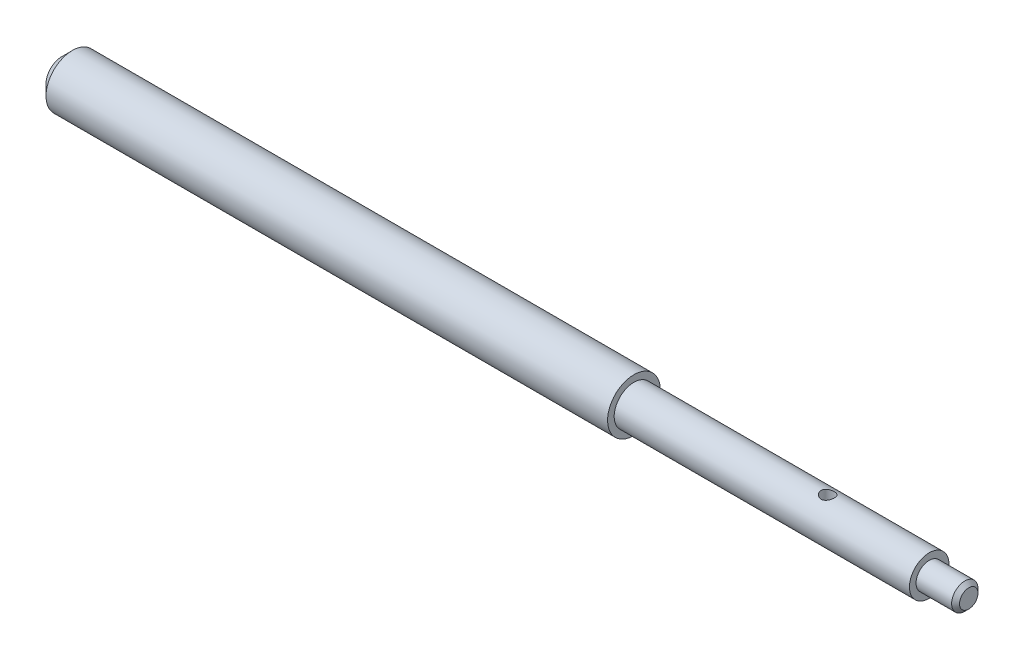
ISO-10303-21;
HEADER;
FILE_DESCRIPTION(('STEP AP214'),'2;1');
FILE_NAME('part.step','',(''),(''),'','','');
FILE_SCHEMA(('AUTOMOTIVE_DESIGN { 1 0 10303 214 1 1 1 1 }'));
ENDSEC;
DATA;
#1=APPLICATION_CONTEXT('core data for automotive mechanical design processes');
#2=APPLICATION_PROTOCOL_DEFINITION('international standard','automotive_design',2000,#1);
#3=PRODUCT_CONTEXT('',#1,'mechanical');
#4=PRODUCT('Part','Part','',(#3));
#5=PRODUCT_RELATED_PRODUCT_CATEGORY('part','',(#4));
#6=PRODUCT_DEFINITION_FORMATION('','',#4);
#7=PRODUCT_DEFINITION_CONTEXT('part definition',#1,'design');
#8=PRODUCT_DEFINITION('design','',#6,#7);
#9=PRODUCT_DEFINITION_SHAPE('','',#8);
#10=(LENGTH_UNIT() NAMED_UNIT(*) SI_UNIT(.MILLI.,.METRE.));
#11=(NAMED_UNIT(*) PLANE_ANGLE_UNIT() SI_UNIT($,.RADIAN.));
#12=(NAMED_UNIT(*) SI_UNIT($,.STERADIAN.) SOLID_ANGLE_UNIT());
#13=UNCERTAINTY_MEASURE_WITH_UNIT(LENGTH_MEASURE(1.E-05),#10,'distance_accuracy_value','');
#14=(GEOMETRIC_REPRESENTATION_CONTEXT(3) GLOBAL_UNCERTAINTY_ASSIGNED_CONTEXT((#13)) GLOBAL_UNIT_ASSIGNED_CONTEXT((#10,
#11,#12)) REPRESENTATION_CONTEXT('',''));
#15=CARTESIAN_POINT('',(0.,0.,0.));
#16=DIRECTION('',(0.,0.,1.));
#17=DIRECTION('',(1.,0.,0.));
#18=AXIS2_PLACEMENT_3D('',#15,#16,#17);
#19=CARTESIAN_POINT('',(303.948321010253,9.92894053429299,0.));
#20=DIRECTION('',(1.,0.,0.));
#21=DIRECTION('',(0.,0.,-1.));
#22=AXIS2_PLACEMENT_3D('',#19,#20,#21);
#23=PLANE('',#22);
#24=CARTESIAN_POINT('',(303.948321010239,7.428940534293,0.));
#25=DIRECTION('',(-1.,0.,0.));
#26=DIRECTION('',(0.,0.,1.));
#27=AXIS2_PLACEMENT_3D('',#24,#25,#26);
#28=CIRCLE('',#27,3.50000000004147);
#29=CARTESIAN_POINT('',(303.948321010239,7.428940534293,3.50000000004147));
#30=VERTEX_POINT('',#29);
#31=EDGE_CURVE('E20',#30,#30,#28,.T.);
#32=ORIENTED_EDGE('',*,*,#31,.F.);
#33=EDGE_LOOP('',(#32));
#34=FACE_BOUND('',#33,.T.);
#35=ADVANCED_FACE('F16',(#34),#23,.T.);
#36=CARTESIAN_POINT('',(302.448321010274,7.428940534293,0.));
#37=DIRECTION('',(-1.,0.,0.));
#38=DIRECTION('',(0.,0.,1.));
#39=AXIS2_PLACEMENT_3D('',#36,#37,#38);
#40=CONICAL_SURFACE('',#39,5.000000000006,0.785398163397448);
#41=CARTESIAN_POINT('',(302.448321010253,7.428940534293,0.));
#42=DIRECTION('',(1.,0.,0.));
#43=DIRECTION('',(0.,1.,0.));
#44=AXIS2_PLACEMENT_3D('',#41,#42,#43);
#45=CIRCLE('',#44,4.99999999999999);
#46=CARTESIAN_POINT('',(302.448321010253,12.428940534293,0.));
#47=VERTEX_POINT('',#46);
#48=EDGE_CURVE('E39',#47,#47,#45,.F.);
#49=ORIENTED_EDGE('',*,*,#48,.F.);
#50=EDGE_LOOP('',(#49));
#51=FACE_BOUND('',#50,.T.);
#52=ORIENTED_EDGE('',*,*,#31,.T.);
#53=EDGE_LOOP('',(#52));
#54=FACE_BOUND('',#53,.T.);
#55=ADVANCED_FACE('F32',(#51,#54),#40,.T.);
#56=CARTESIAN_POINT('',(-12.0516789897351,7.42894053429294,0.));
#57=DIRECTION('',(-1.,0.,0.));
#58=DIRECTION('',(0.,-1.,0.));
#59=AXIS2_PLACEMENT_3D('',#56,#57,#58);
#60=CONICAL_SURFACE('',#59,4.18799999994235,1.02974425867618);
#61=CARTESIAN_POINT('',(-9.53527471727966,7.42894053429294,0.));
#62=VERTEX_POINT('',#61);
#63=VERTEX_LOOP('',#62);
#64=FACE_BOUND('',#63,.T.);
#65=CARTESIAN_POINT('',(-12.0516789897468,7.42894053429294,0.));
#66=DIRECTION('',(-1.,0.,0.));
#67=DIRECTION('',(0.,-1.,0.));
#68=AXIS2_PLACEMENT_3D('',#65,#66,#67);
#69=CIRCLE('',#68,4.188);
#70=CARTESIAN_POINT('',(-12.0516789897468,3.24094053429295,0.));
#71=VERTEX_POINT('',#70);
#72=EDGE_CURVE('E36',#71,#71,#69,.T.);
#73=ORIENTED_EDGE('',*,*,#72,.T.);
#74=EDGE_LOOP('',(#73));
#75=FACE_BOUND('',#74,.T.);
#76=ADVANCED_FACE('F28',(#64,#75),#60,.F.);
#77=CARTESIAN_POINT('',(296.448321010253,7.42894053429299,0.));
#78=DIRECTION('',(1.,0.,0.));
#79=DIRECTION('',(0.,1.,0.));
#80=AXIS2_PLACEMENT_3D('',#77,#78,#79);
#81=CYLINDRICAL_SURFACE('',#80,4.99999999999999);
#82=ORIENTED_EDGE('',*,*,#48,.T.);
#83=EDGE_LOOP('',(#82));
#84=FACE_BOUND('',#83,.T.);
#85=CARTESIAN_POINT('',(288.948321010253,7.42894053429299,0.));
#86=DIRECTION('',(1.,0.,0.));
#87=DIRECTION('',(0.,1.,0.));
#88=AXIS2_PLACEMENT_3D('',#85,#86,#87);
#89=CIRCLE('',#88,4.99999999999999);
#90=CARTESIAN_POINT('',(288.948321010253,12.428940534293,0.));
#91=VERTEX_POINT('',#90);
#92=EDGE_CURVE('E38',#91,#91,#89,.F.);
#93=ORIENTED_EDGE('',*,*,#92,.F.);
#94=EDGE_LOOP('',(#93));
#95=FACE_BOUND('',#94,.T.);
#96=ADVANCED_FACE('F31',(#84,#95),#81,.T.);
#97=CARTESIAN_POINT('',(-26.0516789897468,7.42894053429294,0.));
#98=DIRECTION('',(-1.,0.,0.));
#99=DIRECTION('',(0.,-1.,0.));
#100=AXIS2_PLACEMENT_3D('',#97,#98,#99);
#101=CYLINDRICAL_SURFACE('',#100,4.188);
#102=CARTESIAN_POINT('',(-40.0516789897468,7.42894053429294,0.));
#103=DIRECTION('',(-1.,0.,0.));
#104=DIRECTION('',(0.,-1.,0.));
#105=AXIS2_PLACEMENT_3D('',#102,#103,#104);
#106=CIRCLE('',#105,4.188);
#107=CARTESIAN_POINT('',(-40.0516789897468,3.24094053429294,0.));
#108=VERTEX_POINT('',#107);
#109=EDGE_CURVE('E42',#108,#108,#106,.F.);
#110=ORIENTED_EDGE('',*,*,#109,.F.);
#111=EDGE_LOOP('',(#110));
#112=FACE_BOUND('',#111,.T.);
#113=ORIENTED_EDGE('',*,*,#72,.F.);
#114=EDGE_LOOP('',(#113));
#115=FACE_BOUND('',#114,.T.);
#116=ADVANCED_FACE('F83',(#112,#115),#101,.F.);
#117=CARTESIAN_POINT('',(288.948321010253,13.678940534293,0.));
#118=DIRECTION('',(1.,0.,0.));
#119=DIRECTION('',(0.,0.,-1.));
#120=AXIS2_PLACEMENT_3D('',#117,#118,#119);
#121=PLANE('',#120);
#122=CARTESIAN_POINT('',(288.948321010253,7.42894053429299,0.));
#123=DIRECTION('',(1.,0.,0.));
#124=DIRECTION('',(0.,1.,0.));
#125=AXIS2_PLACEMENT_3D('',#122,#123,#124);
#126=CIRCLE('',#125,7.5);
#127=CARTESIAN_POINT('',(288.948321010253,14.928940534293,0.));
#128=VERTEX_POINT('',#127);
#129=EDGE_CURVE('E60',#128,#128,#126,.F.);
#130=ORIENTED_EDGE('',*,*,#129,.F.);
#131=EDGE_LOOP('',(#130));
#132=FACE_BOUND('',#131,.T.);
#133=ORIENTED_EDGE('',*,*,#92,.T.);
#134=EDGE_LOOP('',(#133));
#135=FACE_BOUND('',#134,.T.);
#136=ADVANCED_FACE('F85',(#132,#135),#121,.T.);
#137=CARTESIAN_POINT('',(250.448321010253,-330.231891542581,0.));
#138=DIRECTION('',(0.,1.,0.));
#139=DIRECTION('',(0.,0.,1.));
#140=AXIS2_PLACEMENT_3D('',#137,#138,#139);
#141=CYLINDRICAL_SURFACE('',#140,2.5);
#142=CARTESIAN_POINT('',(252.948321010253,-0.0710594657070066,0.));
#143=CARTESIAN_POINT('',(252.948315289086,-0.0710553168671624,-0.136314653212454));
#144=CARTESIAN_POINT('',(252.937127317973,-0.0673054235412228,-0.272697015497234));
#145=CARTESIAN_POINT('',(252.892775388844,-0.0526992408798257,-0.541513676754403));
#146=CARTESIAN_POINT('',(252.859592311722,-0.0418367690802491,-0.673944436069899));
#147=CARTESIAN_POINT('',(252.772519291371,-0.0141908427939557,-0.93083838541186));
#148=CARTESIAN_POINT('',(252.718670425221,0.0025808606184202,-1.0553168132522));
#149=CARTESIAN_POINT('',(252.591957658,0.0403323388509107,-1.29345457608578));
#150=CARTESIAN_POINT('',(252.51909274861,0.0613123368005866,-1.40711333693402));
#151=CARTESIAN_POINT('',(252.353757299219,0.106087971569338,-1.62435286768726));
#152=CARTESIAN_POINT('',(252.260744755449,0.12995115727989,-1.72750715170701));
#153=CARTESIAN_POINT('',(252.058905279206,0.177432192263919,-1.9170800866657));
#154=CARTESIAN_POINT('',(251.950074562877,0.201049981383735,-2.00349472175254));
#155=CARTESIAN_POINT('',(251.71585817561,0.246107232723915,-2.15956236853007));
#156=CARTESIAN_POINT('',(251.590086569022,0.267464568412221,-2.22866219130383));
#157=CARTESIAN_POINT('',(251.327880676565,0.304557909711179,-2.34454722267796));
#158=CARTESIAN_POINT('',(251.191449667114,0.320295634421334,-2.39133925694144));
#159=CARTESIAN_POINT('',(250.916637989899,0.343657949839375,-2.45968364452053));
#160=CARTESIAN_POINT('',(250.778478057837,0.351538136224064,-2.48203360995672));
#161=CARTESIAN_POINT('',(250.50016169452,0.359049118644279,-2.50335280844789));
#162=CARTESIAN_POINT('',(250.360005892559,0.358682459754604,-2.5023292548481));
#163=CARTESIAN_POINT('',(250.088479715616,0.349965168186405,-2.47754978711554));
#164=CARTESIAN_POINT('',(249.957000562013,0.341980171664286,-2.45483488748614));
#165=CARTESIAN_POINT('',(249.699837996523,0.319524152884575,-2.38901558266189));
#166=CARTESIAN_POINT('',(249.574155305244,0.305052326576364,-2.34590864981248));
#167=CARTESIAN_POINT('',(249.329785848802,0.270992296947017,-2.2398462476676));
#168=CARTESIAN_POINT('',(249.211244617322,0.251325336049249,-2.17658185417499));
#169=CARTESIAN_POINT('',(248.986138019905,0.209125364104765,-2.03221830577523));
#170=CARTESIAN_POINT('',(248.879575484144,0.186591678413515,-1.95111494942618));
#171=CARTESIAN_POINT('',(248.675609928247,0.139761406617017,-1.76838980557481));
#172=CARTESIAN_POINT('',(248.578972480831,0.11543411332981,-1.66591968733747));
#173=CARTESIAN_POINT('',(248.404019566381,0.0687747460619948,-1.44588748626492));
#174=CARTESIAN_POINT('',(248.325712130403,0.0464435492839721,-1.32831882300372));
#175=CARTESIAN_POINT('',(248.189021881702,0.00599537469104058,-1.07976849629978));
#176=CARTESIAN_POINT('',(248.130859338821,-0.012074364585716,-0.948657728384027));
#177=CARTESIAN_POINT('',(248.037750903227,-0.0415932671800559,-0.677907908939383));
#178=CARTESIAN_POINT('',(248.002757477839,-0.0530559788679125,-0.538286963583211));
#179=CARTESIAN_POINT('',(247.969457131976,-0.0640354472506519,-0.331144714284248));
#180=CARTESIAN_POINT('',(247.961540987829,-0.0666615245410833,-0.265203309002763));
#181=CARTESIAN_POINT('',(247.950971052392,-0.0701748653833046,-0.132852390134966));
#182=CARTESIAN_POINT('',(247.948317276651,-0.0710621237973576,-0.0664428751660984));
#183=CARTESIAN_POINT('',(247.94832866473,-0.0710540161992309,0.136218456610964));
#184=CARTESIAN_POINT('',(247.959506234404,-0.0673081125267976,0.272577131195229));
#185=CARTESIAN_POINT('',(248.003839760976,-0.052708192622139,0.541419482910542));
#186=CARTESIAN_POINT('',(248.037032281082,-0.0418423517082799,0.673896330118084));
#187=CARTESIAN_POINT('',(248.124127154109,-0.0141893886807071,0.930848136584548));
#188=CARTESIAN_POINT('',(248.177982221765,0.00258420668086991,1.05534061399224));
#189=CARTESIAN_POINT('',(248.304698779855,0.0403364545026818,1.29347783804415));
#190=CARTESIAN_POINT('',(248.377557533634,0.0613145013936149,1.40712414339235));
#191=CARTESIAN_POINT('',(248.542875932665,0.106085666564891,1.62434137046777));
#192=CARTESIAN_POINT('',(248.635877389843,0.129946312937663,1.72748595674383));
#193=CARTESIAN_POINT('',(248.837715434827,0.177427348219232,1.9170626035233));
#194=CARTESIAN_POINT('',(248.946559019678,0.201047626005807,2.00348723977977));
#195=CARTESIAN_POINT('',(249.180836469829,0.246118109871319,2.1595993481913));
#196=CARTESIAN_POINT('',(249.306661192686,0.267485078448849,2.22872605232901));
#197=CARTESIAN_POINT('',(249.568903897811,0.304572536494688,2.34459310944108));
#198=CARTESIAN_POINT('',(249.705308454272,0.320300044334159,2.39136131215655));
#199=CARTESIAN_POINT('',(249.943325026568,0.340543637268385,2.45056654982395));
#200=CARTESIAN_POINT('',(250.043304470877,0.346999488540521,2.4690650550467));
#201=CARTESIAN_POINT('',(250.244950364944,0.355665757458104,2.49378342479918));
#202=CARTESIAN_POINT('',(250.346616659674,0.357876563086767,2.50000441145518));
#203=CARTESIAN_POINT('',(250.584398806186,0.357867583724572,2.49999409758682));
#204=CARTESIAN_POINT('',(250.720544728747,0.353897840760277,2.48884364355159));
#205=CARTESIAN_POINT('',(250.98886910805,0.338511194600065,2.44465430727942));
#206=CARTESIAN_POINT('',(251.121043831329,0.327087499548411,2.41159546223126));
#207=CARTESIAN_POINT('',(251.377395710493,0.298233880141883,2.32488474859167));
#208=CARTESIAN_POINT('',(251.501590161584,0.280817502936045,2.27127929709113));
#209=CARTESIAN_POINT('',(251.739240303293,0.241959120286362,2.14514239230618));
#210=CARTESIAN_POINT('',(251.852695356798,0.220516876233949,2.07260981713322));
#211=CARTESIAN_POINT('',(252.07011017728,0.175080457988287,1.9076360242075));
#212=CARTESIAN_POINT('',(252.173589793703,0.151022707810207,1.81457938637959));
#213=CARTESIAN_POINT('',(252.363821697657,0.103598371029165,1.61248899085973));
#214=CARTESIAN_POINT('',(252.450568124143,0.0802320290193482,1.50344965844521));
#215=CARTESIAN_POINT('',(252.607054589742,0.0360834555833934,1.26895960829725));
#216=CARTESIAN_POINT('',(252.676283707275,0.0153859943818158,1.1431508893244));
#217=CARTESIAN_POINT('',(252.792345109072,-0.0203129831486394,0.880938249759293));
#218=CARTESIAN_POINT('',(252.839204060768,-0.0353212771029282,0.744547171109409));
#219=CARTESIAN_POINT('',(252.898630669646,-0.0546080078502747,0.506299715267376));
#220=CARTESIAN_POINT('',(252.917226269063,-0.0607428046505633,0.406056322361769));
#221=CARTESIAN_POINT('',(252.942073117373,-0.0689699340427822,0.203887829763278));
#222=CARTESIAN_POINT('',(252.948325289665,-0.0710625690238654,0.101962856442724));
#223=CARTESIAN_POINT('',(252.948321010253,-0.0710594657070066,0.));
#224=B_SPLINE_CURVE_WITH_KNOTS('',3,(#142,#143,#144,#145,#146,#147,#148,#149,#150,#151,#152,
#153,#154,#155,#156,#157,#158,#159,#160,#161,#162,#163,#164,#165,#166,#167,#168,#169,#170,#171,
#172,#173,#174,#175,#176,#177,#178,#179,#180,#181,#182,#183,#184,#185,#186,#187,#188,#189,#190,
#191,#192,#193,#194,#195,#196,#197,#198,#199,#200,#201,#202,#203,#204,#205,#206,#207,#208,#209,
#210,#211,#212,#213,#214,#215,#216,#217,#218,#219,#220,#221,#222,#223),.UNSPECIFIED.,.T.,.F.,(4,
2,2,2,2,2,2,2,2,2,2,2,2,2,2,2,2,2,2,2,2,2,2,2,2,2,2,2,2,2,2,2,2,2,2,2,2,2,2,2,4),(0.,
0.408561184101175,0.817477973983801,1.22558614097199,1.63371595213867,2.05461297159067,
2.47561083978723,2.90870978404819,3.34167612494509,3.76004804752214,4.17829085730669,
4.57741982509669,4.97659827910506,5.38221510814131,5.78792757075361,6.21475977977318,
6.64177865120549,7.07332926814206,7.50399176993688,7.70319475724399,7.90239833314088,
8.3107973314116,8.71987631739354,9.12802467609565,9.53611429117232,9.95696851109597,
10.3780091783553,10.8113124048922,11.2440744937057,11.5489281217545,11.8537538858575,
12.261602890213,12.6698240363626,13.0771283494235,13.4844568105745,13.9062474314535,
14.3281855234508,14.7612919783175,15.1938808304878,15.4995059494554,15.8051082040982),.UNSPECIFIED.);
#225=CARTESIAN_POINT('',(252.948321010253,-0.0710594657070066,0.));
#226=VERTEX_POINT('',#225);
#227=EDGE_CURVE('E53',#226,#226,#224,.T.);
#228=ORIENTED_EDGE('',*,*,#227,.F.);
#229=EDGE_LOOP('',(#228));
#230=FACE_BOUND('',#229,.T.);
#231=CARTESIAN_POINT('',(247.948321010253,14.928940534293,0.));
#232=CARTESIAN_POINT('',(247.948328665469,14.9289350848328,-0.136218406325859));
#233=CARTESIAN_POINT('',(247.959506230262,14.9251891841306,-0.27257703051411));
#234=CARTESIAN_POINT('',(248.003839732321,14.9105892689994,-0.541419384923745));
#235=CARTESIAN_POINT('',(248.037032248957,14.8997234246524,-0.6738962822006));
#236=CARTESIAN_POINT('',(248.12412669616,14.8720706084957,-0.930846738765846));
#237=CARTESIAN_POINT('',(248.177981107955,14.8552972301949,-1.05533790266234));
#238=CARTESIAN_POINT('',(248.304697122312,14.817545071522,-1.29347534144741));
#239=CARTESIAN_POINT('',(248.377556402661,14.7965668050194,-1.40712293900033));
#240=CARTESIAN_POINT('',(248.542883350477,14.7517934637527,-1.62435082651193));
#241=CARTESIAN_POINT('',(248.635894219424,14.7279306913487,-1.72750371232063));
#242=CARTESIAN_POINT('',(248.837733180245,14.6804496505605,-1.91707732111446));
#243=CARTESIAN_POINT('',(248.946565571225,14.6568314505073,-2.00349348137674));
#244=CARTESIAN_POINT('',(249.180784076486,14.6117737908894,-2.1595625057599));
#245=CARTESIAN_POINT('',(249.306555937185,14.5904164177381,-2.22866245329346));
#246=CARTESIAN_POINT('',(249.568761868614,14.5533230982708,-2.34454740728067));
#247=CARTESIAN_POINT('',(249.705192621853,14.537585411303,-2.39133932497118));
#248=CARTESIAN_POINT('',(249.980004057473,14.5142231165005,-2.45968364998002));
#249=CARTESIAN_POINT('',(250.118164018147,14.5063429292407,-2.48203361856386));
#250=CARTESIAN_POINT('',(250.396480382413,14.4988319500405,-2.50335280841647));
#251=CARTESIAN_POINT('',(250.536636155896,14.4991986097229,-2.50232925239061));
#252=CARTESIAN_POINT('',(250.808162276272,14.5079158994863,-2.47754978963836));
#253=CARTESIAN_POINT('',(250.939641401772,14.5159008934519,-2.45483489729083));
#254=CARTESIAN_POINT('',(251.196803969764,14.5383569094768,-2.38901560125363));
#255=CARTESIAN_POINT('',(251.322486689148,14.5528287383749,-2.34590866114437));
#256=CARTESIAN_POINT('',(251.56685617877,14.5868887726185,-2.23984624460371));
#257=CARTESIAN_POINT('',(251.68539741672,14.6065557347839,-2.17658184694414));
#258=CARTESIAN_POINT('',(251.910504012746,14.6487557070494,-2.03221829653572));
#259=CARTESIAN_POINT('',(252.01706654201,14.6712893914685,-1.95111494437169));
#260=CARTESIAN_POINT('',(252.221032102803,14.7181196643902,-1.76838979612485));
#261=CARTESIAN_POINT('',(252.317669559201,14.7424469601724,-1.66591966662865));
#262=CARTESIAN_POINT('',(252.492622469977,14.7891063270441,-1.44588746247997));
#263=CARTESIAN_POINT('',(252.570929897,14.8114375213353,-1.32831881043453));
#264=CARTESIAN_POINT('',(252.70762011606,14.851885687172,-1.07976853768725));
#265=CARTESIAN_POINT('',(252.765782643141,14.8699554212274,-0.94865781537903));
#266=CARTESIAN_POINT('',(252.858891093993,14.8994743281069,-0.677908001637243));
#267=CARTESIAN_POINT('',(252.893884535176,14.9109370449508,-0.538287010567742));
#268=CARTESIAN_POINT('',(252.927184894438,14.9219165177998,-0.331144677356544));
#269=CARTESIAN_POINT('',(252.935101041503,14.9245425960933,-0.265203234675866));
#270=CARTESIAN_POINT('',(252.945670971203,14.9280559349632,-0.132852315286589));
#271=CARTESIAN_POINT('',(252.948324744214,14.9289431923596,-0.0664428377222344));
#272=CARTESIAN_POINT('',(252.948313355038,14.9289350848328,0.136218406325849));
#273=CARTESIAN_POINT('',(252.937135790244,14.9251891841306,0.272577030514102));
#274=CARTESIAN_POINT('',(252.892802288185,14.9105892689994,0.541419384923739));
#275=CARTESIAN_POINT('',(252.85960977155,14.8997234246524,0.673896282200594));
#276=CARTESIAN_POINT('',(252.772515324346,14.8720706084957,0.930846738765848));
#277=CARTESIAN_POINT('',(252.718660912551,14.8552972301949,1.05533790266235));
#278=CARTESIAN_POINT('',(252.591944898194,14.817545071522,1.29347534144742));
#279=CARTESIAN_POINT('',(252.519085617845,14.7965668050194,1.40712293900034));
#280=CARTESIAN_POINT('',(252.353758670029,14.7517934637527,1.62435082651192));
#281=CARTESIAN_POINT('',(252.260747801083,14.7279306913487,1.72750371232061));
#282=CARTESIAN_POINT('',(252.058908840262,14.6804496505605,1.91707732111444));
#283=CARTESIAN_POINT('',(251.950076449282,14.6568314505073,2.00349348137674));
#284=CARTESIAN_POINT('',(251.71585794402,14.6117737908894,2.15956250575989));
#285=CARTESIAN_POINT('',(251.590086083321,14.5904164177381,2.22866245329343));
#286=CARTESIAN_POINT('',(251.327880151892,14.5533230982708,2.34454740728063));
#287=CARTESIAN_POINT('',(251.191449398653,14.537585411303,2.39133932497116));
#288=CARTESIAN_POINT('',(250.916637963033,14.5142231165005,2.45968364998));
#289=CARTESIAN_POINT('',(250.778478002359,14.5063429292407,2.48203361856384));
#290=CARTESIAN_POINT('',(250.500161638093,14.4988319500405,2.50335280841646));
#291=CARTESIAN_POINT('',(250.36000586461,14.4991986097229,2.5023292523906));
#292=CARTESIAN_POINT('',(250.088479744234,14.5079158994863,2.47754978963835));
#293=CARTESIAN_POINT('',(249.957000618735,14.5159008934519,2.45483489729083));
#294=CARTESIAN_POINT('',(249.699838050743,14.5383569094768,2.38901560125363));
#295=CARTESIAN_POINT('',(249.574155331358,14.5528287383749,2.34590866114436));
#296=CARTESIAN_POINT('',(249.329785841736,14.5868887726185,2.23984624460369));
#297=CARTESIAN_POINT('',(249.211244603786,14.6065557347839,2.17658184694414));
#298=CARTESIAN_POINT('',(248.98613800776,14.6487557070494,2.03221829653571));
#299=CARTESIAN_POINT('',(248.879575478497,14.6712893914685,1.95111494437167));
#300=CARTESIAN_POINT('',(248.675609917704,14.7181196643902,1.76838979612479));
#301=CARTESIAN_POINT('',(248.578972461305,14.7424469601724,1.66591966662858));
#302=CARTESIAN_POINT('',(248.404019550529,14.7891063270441,1.44588746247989));
#303=CARTESIAN_POINT('',(248.325712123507,14.8114375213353,1.32831881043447));
#304=CARTESIAN_POINT('',(248.189021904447,14.851885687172,1.07976853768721));
#305=CARTESIAN_POINT('',(248.130859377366,14.8699554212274,0.948657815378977));
#306=CARTESIAN_POINT('',(248.037750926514,14.8994743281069,0.677908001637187));
#307=CARTESIAN_POINT('',(248.00275748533,14.9109370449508,0.538287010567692));
#308=CARTESIAN_POINT('',(247.969457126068,14.9219165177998,0.331144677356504));
#309=CARTESIAN_POINT('',(247.961540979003,14.9245425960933,0.265203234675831));
#310=CARTESIAN_POINT('',(247.950971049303,14.9280559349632,0.132852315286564));
#311=CARTESIAN_POINT('',(247.948317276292,14.9289431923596,0.0664428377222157));
#312=CARTESIAN_POINT('',(247.948321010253,14.928940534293,0.));
#313=B_SPLINE_CURVE_WITH_KNOTS('',3,(#231,#232,#233,#234,#235,#236,#237,#238,#239,#240,#241,
#242,#243,#244,#245,#246,#247,#248,#249,#250,#251,#252,#253,#254,#255,#256,#257,#258,#259,#260,
#261,#262,#263,#264,#265,#266,#267,#268,#269,#270,#271,#272,#273,#274,#275,#276,#277,#278,#279,
#280,#281,#282,#283,#284,#285,#286,#287,#288,#289,#290,#291,#292,#293,#294,#295,#296,#297,#298,
#299,#300,#301,#302,#303,#304,#305,#306,#307,#308,#309,#310,#311,#312),.UNSPECIFIED.,.T.,.F.,(4,
2,2,2,2,2,2,2,2,2,2,2,2,2,2,2,2,2,2,2,2,2,2,2,2,2,2,2,2,2,2,2,2,2,2,2,2,2,2,2,4),(0.,
0.408398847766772,0.817477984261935,1.2256218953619,1.6337159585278,2.05460611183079,
2.47561084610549,2.90871062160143,3.34167613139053,3.76004813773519,4.17829086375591,
4.57741974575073,4.97659828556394,5.382215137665,5.78792757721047,6.2147598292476,
6.64177865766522,7.07332913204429,7.50399177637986,7.7031948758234,7.90239833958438,
8.31079718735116,8.71987632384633,9.12802023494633,9.5361142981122,9.95700445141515,
10.3780091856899,10.8111089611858,11.2440744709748,11.6624464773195,12.0806892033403,
12.4798180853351,12.8789966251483,13.2846134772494,13.6903259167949,14.1171581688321,
14.5441769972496,14.9757274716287,15.4063901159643,15.6055932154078,15.8047966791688),.UNSPECIFIED.);
#314=CARTESIAN_POINT('',(247.948321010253,14.928940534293,0.));
#315=VERTEX_POINT('',#314);
#316=EDGE_CURVE('E74',#315,#315,#313,.T.);
#317=ORIENTED_EDGE('',*,*,#316,.F.);
#318=EDGE_LOOP('',(#317));
#319=FACE_BOUND('',#318,.T.);
#320=ADVANCED_FACE('F62',(#230,#319),#141,.F.);
#321=CARTESIAN_POINT('',(-40.0516789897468,12.4289405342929,0.));
#322=DIRECTION('',(-1.,0.,0.));
#323=DIRECTION('',(0.,-1.,0.));
#324=AXIS2_PLACEMENT_3D('',#321,#322,#323);
#325=PLANE('',#324);
#326=CARTESIAN_POINT('',(-40.0516789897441,7.42894053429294,0.));
#327=DIRECTION('',(1.,0.,0.));
#328=DIRECTION('',(0.,0.,-1.));
#329=AXIS2_PLACEMENT_3D('',#326,#327,#328);
#330=CIRCLE('',#329,5.9999999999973);
#331=CARTESIAN_POINT('',(-40.0516789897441,7.42894053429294,-5.9999999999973));
#332=VERTEX_POINT('',#331);
#333=EDGE_CURVE('E50',#332,#332,#330,.T.);
#334=ORIENTED_EDGE('',*,*,#333,.F.);
#335=EDGE_LOOP('',(#334));
#336=FACE_BOUND('',#335,.T.);
#337=ORIENTED_EDGE('',*,*,#109,.T.);
#338=EDGE_LOOP('',(#337));
#339=FACE_BOUND('',#338,.T.);
#340=ADVANCED_FACE('F71',(#336,#339),#325,.T.);
#341=CARTESIAN_POINT('',(232.948321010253,7.42894053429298,0.));
#342=DIRECTION('',(1.,0.,0.));
#343=DIRECTION('',(0.,1.,0.));
#344=AXIS2_PLACEMENT_3D('',#341,#342,#343);
#345=CYLINDRICAL_SURFACE('',#344,7.5);
#346=ORIENTED_EDGE('',*,*,#316,.T.);
#347=EDGE_LOOP('',(#346));
#348=FACE_BOUND('',#347,.T.);
#349=ORIENTED_EDGE('',*,*,#129,.T.);
#350=EDGE_LOOP('',(#349));
#351=FACE_BOUND('',#350,.T.);
#352=ORIENTED_EDGE('',*,*,#227,.T.);
#353=EDGE_LOOP('',(#352));
#354=FACE_BOUND('',#353,.T.);
#355=CARTESIAN_POINT('',(176.948321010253,7.42894053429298,0.));
#356=DIRECTION('',(1.,0.,0.));
#357=DIRECTION('',(0.,1.,0.));
#358=AXIS2_PLACEMENT_3D('',#355,#356,#357);
#359=CIRCLE('',#358,7.5);
#360=CARTESIAN_POINT('',(176.948321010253,14.928940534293,0.));
#361=VERTEX_POINT('',#360);
#362=EDGE_CURVE('E47',#361,#361,#359,.F.);
#363=ORIENTED_EDGE('',*,*,#362,.F.);
#364=EDGE_LOOP('',(#363));
#365=FACE_BOUND('',#364,.T.);
#366=ADVANCED_FACE('F66',(#348,#351,#354,#365),#345,.T.);
#367=CARTESIAN_POINT('',(-36.0516789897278,7.42894053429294,0.));
#368=DIRECTION('',(1.,0.,0.));
#369=DIRECTION('',(0.,0.,-1.));
#370=AXIS2_PLACEMENT_3D('',#367,#368,#369);
#371=CONICAL_SURFACE('',#370,9.99999999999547,0.78539816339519);
#372=CARTESIAN_POINT('',(-36.0516789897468,7.42894053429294,0.));
#373=DIRECTION('',(1.,0.,0.));
#374=DIRECTION('',(0.,1.,0.));
#375=AXIS2_PLACEMENT_3D('',#372,#373,#374);
#376=CIRCLE('',#375,9.99999999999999);
#377=CARTESIAN_POINT('',(-36.0516789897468,17.4289405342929,0.));
#378=VERTEX_POINT('',#377);
#379=EDGE_CURVE('E24',#378,#378,#376,.T.);
#380=ORIENTED_EDGE('',*,*,#379,.F.);
#381=EDGE_LOOP('',(#380));
#382=FACE_BOUND('',#381,.T.);
#383=ORIENTED_EDGE('',*,*,#333,.T.);
#384=EDGE_LOOP('',(#383));
#385=FACE_BOUND('',#384,.T.);
#386=ADVANCED_FACE('F70',(#382,#385),#371,.T.);
#387=CARTESIAN_POINT('',(176.948321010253,16.178940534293,0.));
#388=DIRECTION('',(1.,0.,0.));
#389=DIRECTION('',(0.,0.,-1.));
#390=AXIS2_PLACEMENT_3D('',#387,#388,#389);
#391=PLANE('',#390);
#392=CARTESIAN_POINT('',(176.948321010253,7.42894053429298,0.));
#393=DIRECTION('',(1.,0.,0.));
#394=DIRECTION('',(0.,1.,0.));
#395=AXIS2_PLACEMENT_3D('',#392,#393,#394);
#396=CIRCLE('',#395,9.99999999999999);
#397=CARTESIAN_POINT('',(176.948321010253,17.428940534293,0.));
#398=VERTEX_POINT('',#397);
#399=EDGE_CURVE('E10',#398,#398,#396,.F.);
#400=ORIENTED_EDGE('',*,*,#399,.F.);
#401=EDGE_LOOP('',(#400));
#402=FACE_BOUND('',#401,.T.);
#403=ORIENTED_EDGE('',*,*,#362,.T.);
#404=EDGE_LOOP('',(#403));
#405=FACE_BOUND('',#404,.T.);
#406=ADVANCED_FACE('F96',(#402,#405),#391,.T.);
#407=CARTESIAN_POINT('',(68.4483210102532,7.42894053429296,0.));
#408=DIRECTION('',(1.,0.,0.));
#409=DIRECTION('',(0.,1.,0.));
#410=AXIS2_PLACEMENT_3D('',#407,#408,#409);
#411=CYLINDRICAL_SURFACE('',#410,9.99999999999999);
#412=ORIENTED_EDGE('',*,*,#379,.T.);
#413=EDGE_LOOP('',(#412));
#414=FACE_BOUND('',#413,.T.);
#415=ORIENTED_EDGE('',*,*,#399,.T.);
#416=EDGE_LOOP('',(#415));
#417=FACE_BOUND('',#416,.T.);
#418=ADVANCED_FACE('F18',(#414,#417),#411,.T.);
#419=CLOSED_SHELL('',(#35,#55,#76,#96,#116,#136,#320,#340,#366,#386,#406,#418));
#420=MANIFOLD_SOLID_BREP('B1',#419);
#421=ADVANCED_BREP_SHAPE_REPRESENTATION('',(#18,#420),#14);
#422=SHAPE_DEFINITION_REPRESENTATION(#9,#421);
ENDSEC;
END-ISO-10303-21;
